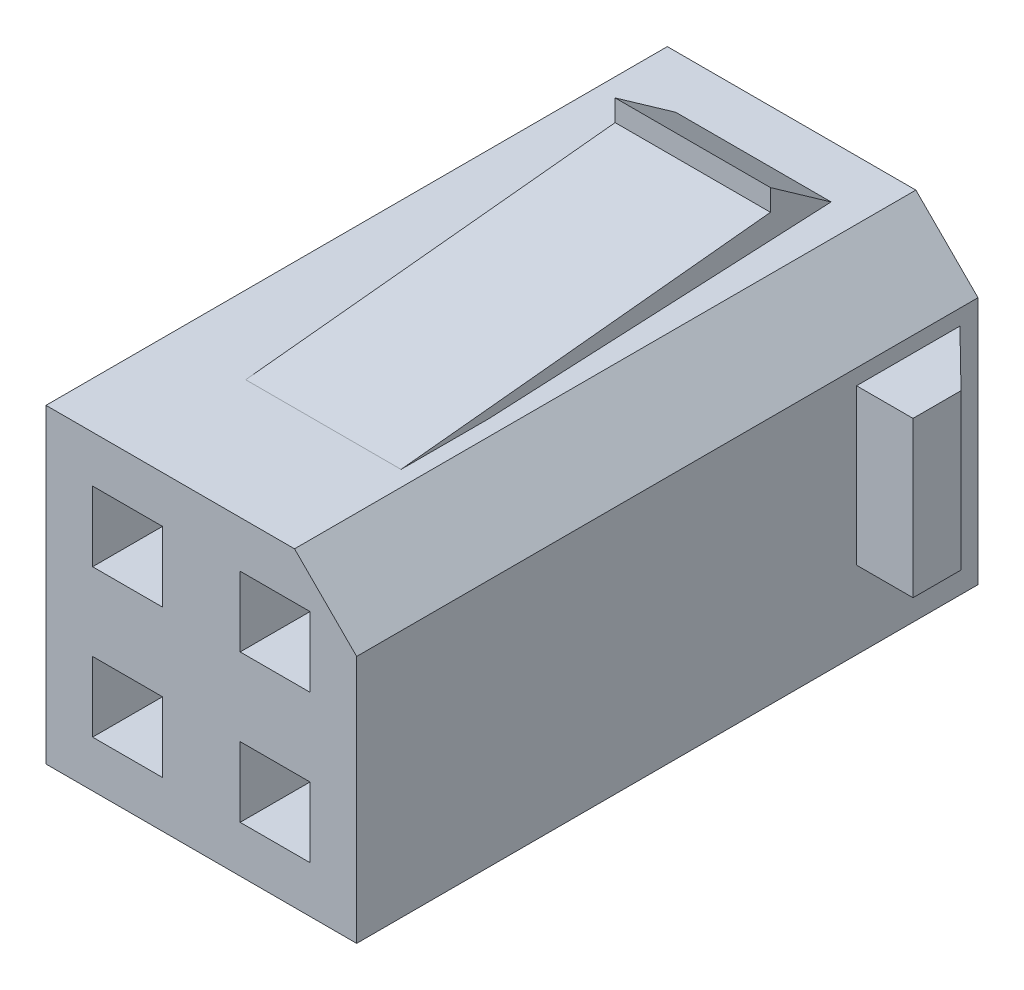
from build123d import *

# Parameters (mm, degrees)
ESQUISSE1_W      = 4.25
ESQUISSE1_H      = 4.25
EXTRUSION1_DEPTH = 15
ESQUISSE2_W      = 2.25
ESQUISSE2_H      = 2.25
EXTRUSION2_DEPTH = 5
EXTRUSION3_DEPTH = 2.5
EXTRUSION4_DEPTH = 2.5


with BuildPart() as part:
    # Esquisse1 → Extrusion1 (new body)
    with BuildSketch(Plane.XY):
        Polygon((-5, 5), (-5, -5), (5, -5), (5, 3), (3, 5), align=None)
        Polygon((2.792893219, 4.5), (4.5, 2.792893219), (4.5, 0.25), (0.25, 0.25), (0.25, 4.5), align=None, mode=Mode.SUBTRACT)
        with Locations((-2.375, 2.375)):
            Rectangle(ESQUISSE1_W, ESQUISSE1_H, mode=Mode.SUBTRACT)
        with Locations((-2.375, -2.375)):
            Rectangle(ESQUISSE1_W, ESQUISSE1_H, mode=Mode.SUBTRACT)
        with Locations((2.375, -2.375)):
            Rectangle(ESQUISSE1_W, ESQUISSE1_H, mode=Mode.SUBTRACT)
    extrude(amount=EXTRUSION1_DEPTH)

    # Esquisse2 → Extrusion2 (add)
    with BuildSketch(Plane.XY.offset(15)):
        Polygon((-5, 5), (-5, -5), (5, -5), (5, 3), (3, 5), align=None)
        with Locations((-2.375, 2.375)):
            Rectangle(ESQUISSE2_W, ESQUISSE2_H, mode=Mode.SUBTRACT)
        with Locations((2.375, 2.375)):
            Rectangle(ESQUISSE2_W, ESQUISSE2_H, mode=Mode.SUBTRACT)
        with Locations((-2.375, -2.375)):
            Rectangle(ESQUISSE2_W, ESQUISSE2_H, mode=Mode.SUBTRACT)
        with Locations((2.375, -2.375)):
            Rectangle(ESQUISSE2_W, ESQUISSE2_H, mode=Mode.SUBTRACT)
    extrude(amount=EXTRUSION2_DEPTH)

    # Esquisse3 → Extrusion3 (add, symmetric)
    with BuildSketch(Plane(origin=(0, 0, 0), x_dir=(1, 0, 0), z_dir=(0, 1, 0))):
        Polygon((5, -0.582293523), (6.818181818, -2.364824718), (6.818181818, -3.909685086), (5, -3.909685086), align=None)
    extrude(amount=EXTRUSION3_DEPTH, both=True)

    # Esquisse4 → Extrusion4 (add, symmetric)
    with BuildSketch(Plane(origin=(0, 0, 0), x_dir=(0, 0, -1), z_dir=(1, 0, 0))):
        Polygon((-16.072084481, 5), (-4.180440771, 6.221303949), (-4.180440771, 6.910009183), (-2.228376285, 5.533638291), (-13.248393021, 5), align=None)
        Polygon((-16.072084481, -5), (-13.248393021, -5), (-2.228376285, -5.559293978), (-4.180440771, -7.001836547), (-4.180440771, -6.290174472), align=None)
    extrude(amount=EXTRUSION4_DEPTH, both=True)


solid = part.part
